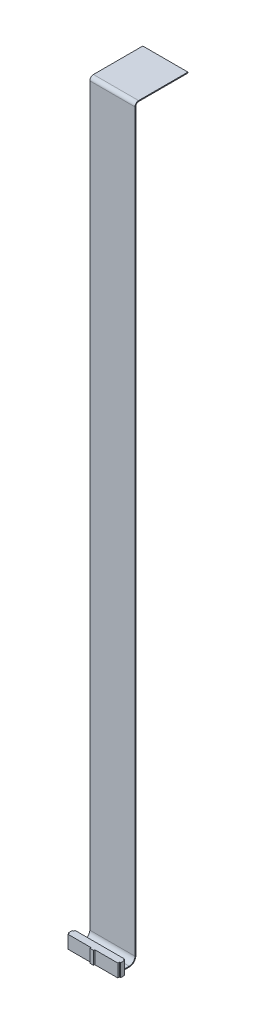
from build123d import *

# Parameters (mm, degrees)
EXTRUDE1_DEPTH = 11.3
SKETCH2_W      = 3
SKETCH2_H      = 0.8
EXTRUDE2_DEPTH = 19.685
SKETCH5_2_W    = 39.37
SKETCH5_2_H    = 0.8


with BuildPart() as part:
    # Sketch1 → Extrude1 (new body)
    with BuildSketch(Plane(origin=(0, 0, 0), x_dir=(1, 0, 0), z_dir=(0, 1, 0))):
        Polygon((-21.685, 6), (21.685, 6), (21.685, 4.7), (22.685, 4.7), (22.685, 1.3), (21.685, 1.3), (21.685, 0), (1.6, 0), (1.6, -1), (-1.6, -1), (-1.6, 0), (-21.685, 0), (-21.685, 1.3), (-22.685, 1.3), (-22.685, 4.7), (-21.685, 4.7), align=None)
    extrude(amount=EXTRUDE1_DEPTH)

    # Sketch2 → Extrude2 (add, symmetric)
    with BuildSketch(Plane(origin=(0, 0, 0), x_dir=(0, 0, -1), z_dir=(1, 0, 0))):
        with Locations((7.5, 1.6)):
            Rectangle(SKETCH2_W, SKETCH2_H)
    extrude(amount=EXTRUDE2_DEPTH, both=True)

    # Sweep3: sweep along a path in PATH-LH
    with BuildLine(Plane(origin=(0, 0, 0), x_dir=(0, 0, -1), z_dir=(1, 0, 0))) as sweep3_path:
        Line((9, 2), (11.9375, 2))
        ThreePointArc((11.9375, 2), (15.473033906, 3.464466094), (16.9375, 7))
        Line((16.9375, 7), (16.9375, 648.34624))
        ThreePointArc((16.9375, 648.34624), (17.86743597, 650.59130403), (20.1125, 651.52124))
        Line((20.1125, 651.52124), (63.1288, 651.52124))
    # Sketch5_2 → Sweep3 (sweep)
    with BuildSketch(Plane(origin=(0, 0, -9), x_dir=(-1, 0, 0), z_dir=(0, 0, -1))):
        with Locations((0, 1.6)):
            Rectangle(SKETCH5_2_W, SKETCH5_2_H)
    sweep(path=sweep3_path.line)


solid = part.part
